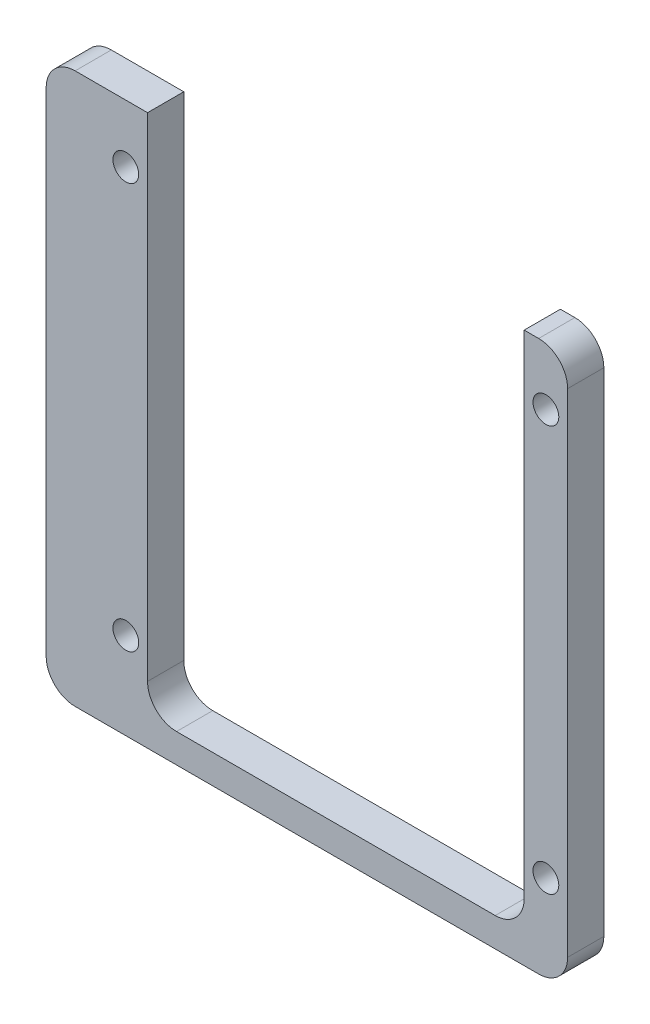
from build123d import *

# Parameters (mm, degrees)
SKETCH1_W             = 45.72
SKETCH1_H             = 48.26
BOSS_EXTRUDE1_DEPTH   = 3.175
SKETCH2_W             = 33.02
SKETCH2_H             = 45.72
CUT_EXTRUDE1_DEPTH    = 34.390374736
F_2_CLEARANCE_HOLE1_D = 2.2606
FILLET1_R             = 2.54


with BuildPart() as part:
    # Sketch1 → Boss-Extrude1 (new body)
    with BuildSketch(Plane.XY):
        Rectangle(SKETCH1_W, SKETCH1_H)
    extrude(amount=BOSS_EXTRUDE1_DEPTH)

    # Sketch2 → Cut-Extrude1 (cut, through all)
    with BuildSketch(Plane.XY.offset(3.175)):
        with Locations((2.54, 1.27)):
            Rectangle(SKETCH2_W, SKETCH2_H)
    extrude(amount=-CUT_EXTRUDE1_DEPTH, mode=Mode.SUBTRACT)

    # 2 Clearance Hole1 (through all)
    with Locations(Plane.XY.offset(3.175)):
        with Locations((20.955, -16.51), (-15.875, 19.05), (-15.875, -16.51), (20.955, 19.05)):
            Hole(F_2_CLEARANCE_HOLE1_D / 2)

    # Fillet1
    fillet1_edges = [part.edges().sort_by_distance(p)[0] for p in [
        (19.05, -21.59, 1.5875),
        (-13.97, -21.59, 1.5875),
        (22.86, -24.13, 1.5875),
        (-22.86, -24.13, 1.5875),
        (-22.86, 24.13, 1.5875),
        (22.86, 24.13, 1.5875),
    ]]
    fillet(fillet1_edges, radius=FILLET1_R)


solid = part.part
